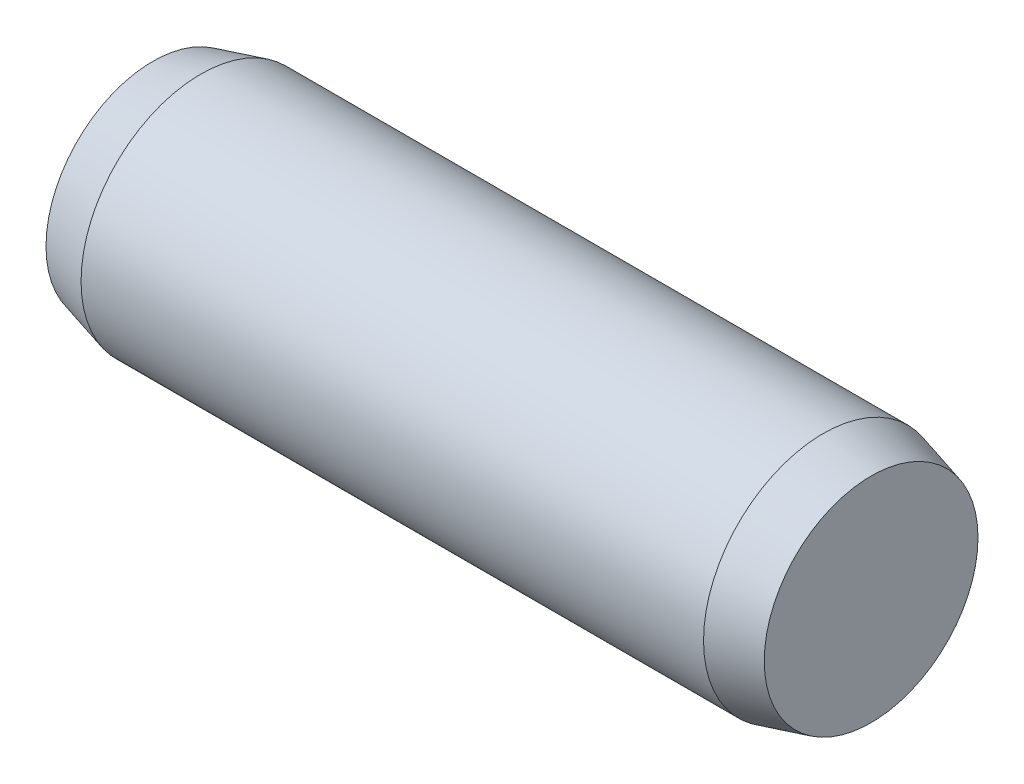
ISO-10303-21;
HEADER;
FILE_DESCRIPTION(('STEP AP214'),'2;1');
FILE_NAME('part.step','',(''),(''),'','','');
FILE_SCHEMA(('AUTOMOTIVE_DESIGN { 1 0 10303 214 1 1 1 1 }'));
ENDSEC;
DATA;
#1=APPLICATION_CONTEXT('core data for automotive mechanical design processes');
#2=APPLICATION_PROTOCOL_DEFINITION('international standard','automotive_design',2000,#1);
#3=PRODUCT_CONTEXT('',#1,'mechanical');
#4=PRODUCT('Part','Part','',(#3));
#5=PRODUCT_RELATED_PRODUCT_CATEGORY('part','',(#4));
#6=PRODUCT_DEFINITION_FORMATION('','',#4);
#7=PRODUCT_DEFINITION_CONTEXT('part definition',#1,'design');
#8=PRODUCT_DEFINITION('design','',#6,#7);
#9=PRODUCT_DEFINITION_SHAPE('','',#8);
#10=(LENGTH_UNIT() NAMED_UNIT(*) SI_UNIT(.MILLI.,.METRE.));
#11=(NAMED_UNIT(*) PLANE_ANGLE_UNIT() SI_UNIT($,.RADIAN.));
#12=(NAMED_UNIT(*) SI_UNIT($,.STERADIAN.) SOLID_ANGLE_UNIT());
#13=UNCERTAINTY_MEASURE_WITH_UNIT(LENGTH_MEASURE(1.E-05),#10,'distance_accuracy_value','');
#14=(GEOMETRIC_REPRESENTATION_CONTEXT(3) GLOBAL_UNCERTAINTY_ASSIGNED_CONTEXT((#13)) GLOBAL_UNIT_ASSIGNED_CONTEXT((#10,
#11,#12)) REPRESENTATION_CONTEXT('',''));
#15=CARTESIAN_POINT('',(0.,0.,0.));
#16=DIRECTION('',(0.,0.,1.));
#17=DIRECTION('',(1.,0.,0.));
#18=AXIS2_PLACEMENT_3D('',#15,#16,#17);
#19=CARTESIAN_POINT('',(0.,0.,-4.46410161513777));
#20=DIRECTION('',(1.,0.,0.));
#21=DIRECTION('',(0.,0.,-1.));
#22=AXIS2_PLACEMENT_3D('',#19,#20,#21);
#23=PLANE('',#22);
#24=CARTESIAN_POINT('',(0.,0.,0.));
#25=DIRECTION('',(-1.,0.,0.));
#26=DIRECTION('',(0.,0.,1.));
#27=AXIS2_PLACEMENT_3D('',#24,#25,#26);
#28=CIRCLE('',#27,4.46410161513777);
#29=CARTESIAN_POINT('',(0.,0.,4.46410161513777));
#30=VERTEX_POINT('',#29);
#31=EDGE_CURVE('E45',#30,#30,#28,.T.);
#32=ORIENTED_EDGE('',*,*,#31,.T.);
#33=EDGE_LOOP('',(#32));
#34=FACE_BOUND('',#33,.T.);
#35=ADVANCED_FACE('F31',(#34),#23,.F.);
#36=CARTESIAN_POINT('',(30.,0.,0.));
#37=DIRECTION('',(-1.,0.,0.));
#38=DIRECTION('',(0.,0.,1.));
#39=AXIS2_PLACEMENT_3D('',#36,#37,#38);
#40=PLANE('',#39);
#41=CARTESIAN_POINT('',(30.,0.,0.));
#42=DIRECTION('',(-1.,0.,0.));
#43=DIRECTION('',(0.,0.,1.));
#44=AXIS2_PLACEMENT_3D('',#41,#42,#43);
#45=CIRCLE('',#44,4.46410161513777);
#46=CARTESIAN_POINT('',(30.,0.,4.46410161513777));
#47=VERTEX_POINT('',#46);
#48=EDGE_CURVE('E10',#47,#47,#45,.T.);
#49=ORIENTED_EDGE('',*,*,#48,.F.);
#50=EDGE_LOOP('',(#49));
#51=FACE_BOUND('',#50,.T.);
#52=ADVANCED_FACE('F65',(#51),#40,.F.);
#53=CARTESIAN_POINT('',(30.,0.,0.));
#54=DIRECTION('',(-1.,0.,0.));
#55=DIRECTION('',(0.,0.,1.));
#56=AXIS2_PLACEMENT_3D('',#53,#54,#55);
#57=CONICAL_SURFACE('',#56,4.46410161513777,0.261799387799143);
#58=CARTESIAN_POINT('',(28.,0.,0.));
#59=DIRECTION('',(-1.,0.,0.));
#60=DIRECTION('',(0.,0.,1.));
#61=AXIS2_PLACEMENT_3D('',#58,#59,#60);
#62=CIRCLE('',#61,5.);
#63=CARTESIAN_POINT('',(28.,0.,5.));
#64=VERTEX_POINT('',#63);
#65=EDGE_CURVE('E37',#64,#64,#62,.T.);
#66=ORIENTED_EDGE('',*,*,#65,.F.);
#67=EDGE_LOOP('',(#66));
#68=FACE_BOUND('',#67,.T.);
#69=ORIENTED_EDGE('',*,*,#48,.T.);
#70=EDGE_LOOP('',(#69));
#71=FACE_BOUND('',#70,.T.);
#72=ADVANCED_FACE('F60',(#68,#71),#57,.T.);
#73=CARTESIAN_POINT('',(0.,0.,0.));
#74=DIRECTION('',(-1.,0.,0.));
#75=DIRECTION('',(0.,0.,1.));
#76=AXIS2_PLACEMENT_3D('',#73,#74,#75);
#77=CYLINDRICAL_SURFACE('',#76,5.);
#78=CARTESIAN_POINT('',(2.,0.,0.));
#79=DIRECTION('',(-1.,0.,0.));
#80=DIRECTION('',(0.,0.,1.));
#81=AXIS2_PLACEMENT_3D('',#78,#79,#80);
#82=CIRCLE('',#81,5.);
#83=CARTESIAN_POINT('',(2.,0.,5.));
#84=VERTEX_POINT('',#83);
#85=EDGE_CURVE('E41',#84,#84,#82,.T.);
#86=ORIENTED_EDGE('',*,*,#85,.F.);
#87=EDGE_LOOP('',(#86));
#88=FACE_BOUND('',#87,.T.);
#89=ORIENTED_EDGE('',*,*,#65,.T.);
#90=EDGE_LOOP('',(#89));
#91=FACE_BOUND('',#90,.T.);
#92=ADVANCED_FACE('F55',(#88,#91),#77,.T.);
#93=CARTESIAN_POINT('',(2.,0.,0.));
#94=DIRECTION('',(1.,0.,0.));
#95=DIRECTION('',(0.,0.,-1.));
#96=AXIS2_PLACEMENT_3D('',#93,#94,#95);
#97=CONICAL_SURFACE('',#96,5.,0.261799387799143);
#98=ORIENTED_EDGE('',*,*,#31,.F.);
#99=EDGE_LOOP('',(#98));
#100=FACE_BOUND('',#99,.T.);
#101=ORIENTED_EDGE('',*,*,#85,.T.);
#102=EDGE_LOOP('',(#101));
#103=FACE_BOUND('',#102,.T.);
#104=ADVANCED_FACE('F52',(#100,#103),#97,.T.);
#105=CLOSED_SHELL('',(#35,#52,#72,#92,#104));
#106=MANIFOLD_SOLID_BREP('B2',#105);
#107=ADVANCED_BREP_SHAPE_REPRESENTATION('',(#18,#106),#14);
#108=SHAPE_DEFINITION_REPRESENTATION(#9,#107);
ENDSEC;
END-ISO-10303-21;
